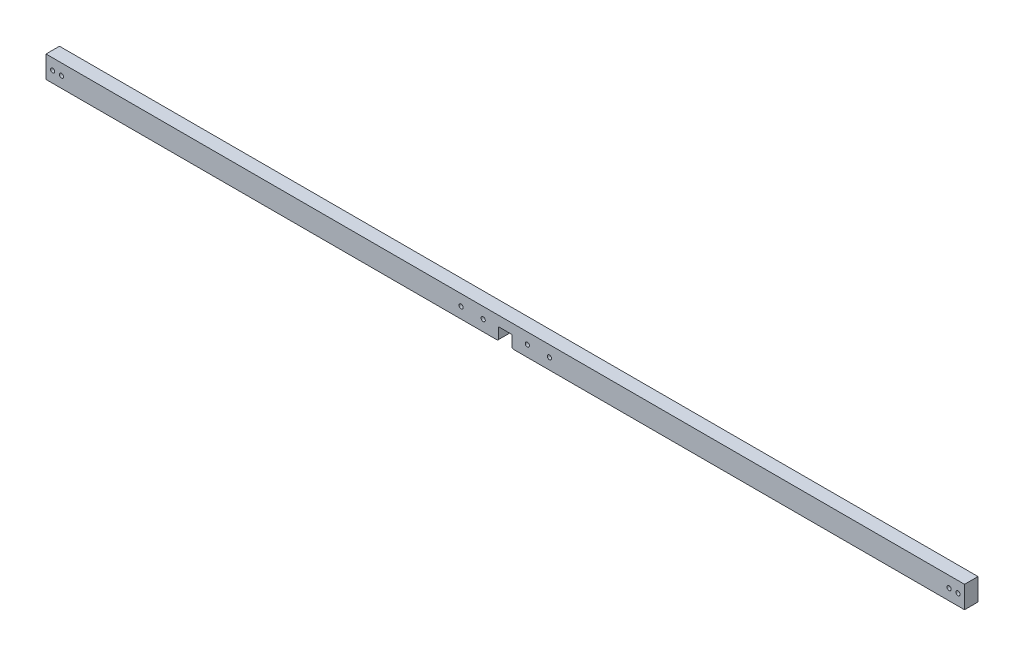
from build123d import *

# Parameters (mm, degrees)
SKETCH1_W           = 416
SKETCH1_H           = 10
BOSS_EXTRUDE1_DEPTH = 3.05
SKETCH2_R           = 0.95
CUT_EXTRUDE1_DEPTH  = 209.14948955
SKETCH4_W           = 6
SKETCH4_H           = 13.062246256
CUT_EXTRUDE2_DEPTH  = 10
CHAMFER1_SIZE       = 0.5


with BuildPart() as part:
    # Sketch1 → Boss-Extrude1 (new, symmetric)
    with BuildSketch(Plane.XY):
        Rectangle(SKETCH1_W, SKETCH1_H)
    extrude(amount=BOSS_EXTRUDE1_DEPTH, both=True)

    # Sketch2 → Cut-Extrude1 (cut, through all)
    with BuildSketch(Plane.XY.offset(3.05)):
        with Locations((10, 0)):
            Circle(SKETCH2_R)
        with Locations((20, 0)):
            Circle(SKETCH2_R)
        with Locations((205, 0)):
            Circle(SKETCH2_R)
        with Locations((201, 0)):
            Circle(SKETCH2_R)
    cut_extrude1 = extrude(amount=-CUT_EXTRUDE1_DEPTH, mode=Mode.SUBTRACT)

    # Mirror1: Cut-Extrude1 across plane
    add(cut_extrude1.mirror(Plane(origin=(0, 0, 0), x_dir=(0, 0, 1), z_dir=(1, 0, 0))), mode=Mode.SUBTRACT)

    # Sketch4 → Cut-Extrude2 (cut)
    with BuildSketch(Plane.XY.offset(3.05)):
        with Locations((0, -6.031123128)):
            Rectangle(SKETCH4_W, SKETCH4_H)
    extrude(amount=-CUT_EXTRUDE2_DEPTH, mode=Mode.SUBTRACT)

    # Chamfer1
    chamfer1_edges = [part.edges().sort_by_distance(p)[0] for p in [
        (3, -5, 0),
        (-3, -5, 0),
    ]]
    chamfer(chamfer1_edges, length=CHAMFER1_SIZE)


solid = part.part
